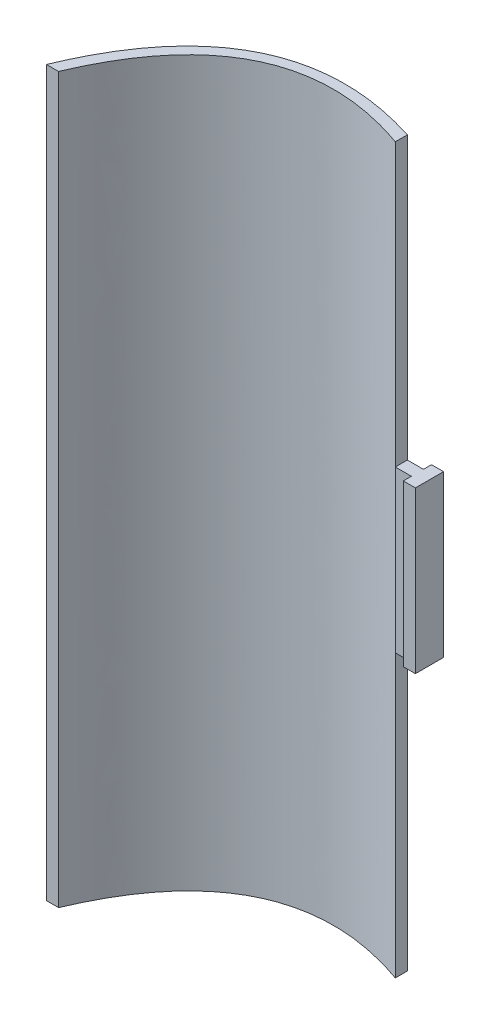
ISO-10303-21;
HEADER;
FILE_DESCRIPTION(('STEP AP214'),'2;1');
FILE_NAME('part.step','',(''),(''),'','','');
FILE_SCHEMA(('AUTOMOTIVE_DESIGN { 1 0 10303 214 1 1 1 1 }'));
ENDSEC;
DATA;
#1=APPLICATION_CONTEXT('core data for automotive mechanical design processes');
#2=APPLICATION_PROTOCOL_DEFINITION('international standard','automotive_design',2000,#1);
#3=PRODUCT_CONTEXT('',#1,'mechanical');
#4=PRODUCT('Part','Part','',(#3));
#5=PRODUCT_RELATED_PRODUCT_CATEGORY('part','',(#4));
#6=PRODUCT_DEFINITION_FORMATION('','',#4);
#7=PRODUCT_DEFINITION_CONTEXT('part definition',#1,'design');
#8=PRODUCT_DEFINITION('design','',#6,#7);
#9=PRODUCT_DEFINITION_SHAPE('','',#8);
#10=(LENGTH_UNIT() NAMED_UNIT(*) SI_UNIT(.MILLI.,.METRE.));
#11=(NAMED_UNIT(*) PLANE_ANGLE_UNIT() SI_UNIT($,.RADIAN.));
#12=(NAMED_UNIT(*) SI_UNIT($,.STERADIAN.) SOLID_ANGLE_UNIT());
#13=UNCERTAINTY_MEASURE_WITH_UNIT(LENGTH_MEASURE(1.E-05),#10,'distance_accuracy_value','');
#14=(GEOMETRIC_REPRESENTATION_CONTEXT(3) GLOBAL_UNCERTAINTY_ASSIGNED_CONTEXT((#13)) GLOBAL_UNIT_ASSIGNED_CONTEXT((#10,
#11,#12)) REPRESENTATION_CONTEXT('',''));
#15=CARTESIAN_POINT('',(0.,0.,0.));
#16=DIRECTION('',(0.,0.,1.));
#17=DIRECTION('',(1.,0.,0.));
#18=AXIS2_PLACEMENT_3D('',#15,#16,#17);
#19=CARTESIAN_POINT('',(0.,0.,0.));
#20=DIRECTION('',(1.,0.,0.));
#21=DIRECTION('',(0.,0.,-1.));
#22=AXIS2_PLACEMENT_3D('',#19,#20,#21);
#23=PLANE('',#22);
#24=DIRECTION('',(2.51650552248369E-13,-1.,-5.47594377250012E-13));
#25=VECTOR('',#24,1.);
#26=CARTESIAN_POINT('',(-2.26485497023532E-11,90.,-21.3963666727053));
#27=LINE('',#26,#25);
#28=CARTESIAN_POINT('',(-1.76155386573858E-11,70.,-21.3963666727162));
#29=VERTEX_POINT('',#28);
#30=CARTESIAN_POINT('',(0.,0.,-21.3963666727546));
#31=VERTEX_POINT('',#30);
#32=EDGE_CURVE('E287',#29,#31,#27,.T.);
#33=ORIENTED_EDGE('',*,*,#32,.F.);
#34=DIRECTION('',(0.,0.,1.));
#35=VECTOR('',#34,1.);
#36=CARTESIAN_POINT('',(0.,70.,-21.3963666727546));
#37=LINE('',#36,#35);
#38=CARTESIAN_POINT('',(0.,70.,-18.3963666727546));
#39=VERTEX_POINT('',#38);
#40=EDGE_CURVE('E80',#29,#39,#37,.T.);
#41=ORIENTED_EDGE('',*,*,#40,.T.);
#42=DIRECTION('',(-2.53541514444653E-13,1.,6.80300723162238E-13));
#43=VECTOR('',#42,1.);
#44=CARTESIAN_POINT('',(-2.2818368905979E-11,90.,-18.3963666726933));
#45=LINE('',#44,#43);
#46=CARTESIAN_POINT('',(0.,0.,-18.3963666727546));
#47=VERTEX_POINT('',#46);
#48=EDGE_CURVE('E186',#47,#39,#45,.T.);
#49=ORIENTED_EDGE('',*,*,#48,.F.);
#50=DIRECTION('',(0.,0.,-1.));
#51=VECTOR('',#50,1.);
#52=CARTESIAN_POINT('',(0.,0.,-21.3963666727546));
#53=LINE('',#52,#51);
#54=EDGE_CURVE('E12',#47,#31,#53,.T.);
#55=ORIENTED_EDGE('',*,*,#54,.T.);
#56=EDGE_LOOP('',(#33,#41,#49,#55));
#57=FACE_BOUND('',#56,.T.);
#58=ADVANCED_FACE('F61',(#57),#23,.T.);
#59=CARTESIAN_POINT('',(-36.0978004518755,0.,-20.7137251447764));
#60=DIRECTION('',(0.,-1.,0.));
#61=DIRECTION('',(0.,0.,-1.));
#62=AXIS2_PLACEMENT_3D('',#59,#60,#61);
#63=PLANE('',#62);
#64=CARTESIAN_POINT('',(0.,0.,-21.3963666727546));
#65=CARTESIAN_POINT('',(-42.195600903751,0.,-34.883026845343));
#66=CARTESIAN_POINT('',(-60.,0.,8.30751978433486));
#67=B_SPLINE_CURVE_WITH_KNOTS('',2,(#64,#65,#66),.UNSPECIFIED.,.F.,.F.,(3,3),(0.,1.),.UNSPECIFIED.);
#68=CARTESIAN_POINT('',(-60.,0.,8.30751978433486));
#69=VERTEX_POINT('',#68);
#70=EDGE_CURVE('E303',#31,#69,#67,.T.);
#71=ORIENTED_EDGE('',*,*,#70,.F.);
#72=ORIENTED_EDGE('',*,*,#54,.F.);
#73=CARTESIAN_POINT('',(-57.,0.,8.30751978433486));
#74=CARTESIAN_POINT('',(-39.7655888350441,0.,-32.5574239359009));
#75=CARTESIAN_POINT('',(0.,0.,-18.3963666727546));
#76=B_SPLINE_CURVE_WITH_KNOTS('',2,(#73,#74,#75),.UNSPECIFIED.,.F.,.F.,(3,3),(0.,1.),.UNSPECIFIED.);
#77=CARTESIAN_POINT('',(-57.,0.,8.30751978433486));
#78=VERTEX_POINT('',#77);
#79=EDGE_CURVE('E72',#78,#47,#76,.T.);
#80=ORIENTED_EDGE('',*,*,#79,.F.);
#81=DIRECTION('',(1.,0.,0.));
#82=VECTOR('',#81,1.);
#83=CARTESIAN_POINT('',(-60.,0.,8.30751978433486));
#84=LINE('',#83,#82);
#85=EDGE_CURVE('E88',#69,#78,#84,.T.);
#86=ORIENTED_EDGE('',*,*,#85,.F.);
#87=EDGE_LOOP('',(#71,#72,#80,#86));
#88=FACE_BOUND('',#87,.T.);
#89=ADVANCED_FACE('F63',(#88),#63,.T.);
#90=CARTESIAN_POINT('',(-34.343404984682,180.,-21.5248402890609));
#91=DIRECTION('',(0.,-1.,0.));
#92=DIRECTION('',(0.,0.,-1.));
#93=AXIS2_PLACEMENT_3D('',#90,#91,#92);
#94=PLANE('',#93);
#95=CARTESIAN_POINT('',(403084.799148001,180.,915165.55683891));
#96=CARTESIAN_POINT('',(-395335.670160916,180.,-918573.026425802));
#97=CARTESIAN_POINT('',(387449.167553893,180.,921894.396651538));
#98=B_SPLINE_CURVE_WITH_KNOTS('',2,(#95,#96,#97),.UNSPECIFIED.,.F.,.F.,(3,3),(0.,1.),.UNSPECIFIED.);
#99=CARTESIAN_POINT('',(0.,180.,-21.3963666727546));
#100=VERTEX_POINT('',#99);
#101=CARTESIAN_POINT('',(-60.,180.,8.30751978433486));
#102=VERTEX_POINT('',#101);
#103=EDGE_CURVE('E191',#100,#102,#98,.T.);
#104=ORIENTED_EDGE('',*,*,#103,.T.);
#105=DIRECTION('',(1.,0.,0.));
#106=VECTOR('',#105,1.);
#107=CARTESIAN_POINT('',(-60.,180.,8.30751978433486));
#108=LINE('',#107,#106);
#109=CARTESIAN_POINT('',(-56.9999999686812,180.,8.30751971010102));
#110=VERTEX_POINT('',#109);
#111=EDGE_CURVE('E194',#102,#110,#108,.T.);
#112=ORIENTED_EDGE('',*,*,#111,.T.);
#113=CARTESIAN_POINT('',(371351.134674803,180.,928495.790330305));
#114=CARTESIAN_POINT('',(-378961.382147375,180.,-925445.308658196));
#115=CARTESIAN_POINT('',(386441.129628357,180.,922316.977564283));
#116=B_SPLINE_CURVE_WITH_KNOTS('',2,(#113,#114,#115),.UNSPECIFIED.,.F.,.F.,(3,3),(0.,1.),.UNSPECIFIED.);
#117=CARTESIAN_POINT('',(0.,180.,-18.3963666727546));
#118=VERTEX_POINT('',#117);
#119=EDGE_CURVE('E523',#110,#118,#116,.T.);
#120=ORIENTED_EDGE('',*,*,#119,.T.);
#121=DIRECTION('',(0.,0.,-1.));
#122=VECTOR('',#121,1.);
#123=CARTESIAN_POINT('',(0.,180.,-21.3963666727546));
#124=LINE('',#123,#122);
#125=EDGE_CURVE('E182',#118,#100,#124,.T.);
#126=ORIENTED_EDGE('',*,*,#125,.T.);
#127=EDGE_LOOP('',(#104,#112,#120,#126));
#128=FACE_BOUND('',#127,.T.);
#129=ADVANCED_FACE('F247',(#128),#94,.F.);
#130=CARTESIAN_POINT('',(-4.56371052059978E-11,180.,-18.3963666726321));
#131=CARTESIAN_POINT('',(0.,0.,-18.3963666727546));
#132=CARTESIAN_POINT('',(-39.7655887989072,180.,-32.5574239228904));
#133=CARTESIAN_POINT('',(-39.7655888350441,0.,-32.5574239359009));
#134=CARTESIAN_POINT('',(-56.9999999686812,180.,8.30751971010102));
#135=CARTESIAN_POINT('',(-57.,0.,8.30751978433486));
#136=B_SPLINE_SURFACE_WITH_KNOTS('',2,1,((#130,#131),(#132,#133),(#134,#135)),.UNSPECIFIED.,.F.,
.F.,.F.,(3,3),(2,2),(0.,1.),(0.,1.),.UNSPECIFIED.);
#137=DIRECTION('',(-1.73993227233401E-10,-1.,4.12410248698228E-10));
#138=VECTOR('',#137,1.);
#139=CARTESIAN_POINT('',(-56.9999999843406,90.,8.30751974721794));
#140=LINE('',#139,#138);
#141=EDGE_CURVE('E262',#110,#78,#140,.T.);
#142=DIRECTION('',(0.,-1.,0.));
#143=VECTOR('',#142,1.);
#144=CARTESIAN_POINT('',(0.,110.,-18.3963666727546));
#145=LINE('',#144,#143);
#146=CARTESIAN_POINT('',(0.,110.,-18.3963666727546));
#147=VERTEX_POINT('',#146);
#148=EDGE_CURVE('E161',#147,#39,#145,.T.);
#149=EDGE_CURVE('E66',#147,#118,#45,.T.);
#150=ORIENTED_EDGE('',*,*,#119,.F.);
#151=ORIENTED_EDGE('',*,*,#141,.T.);
#152=ORIENTED_EDGE('',*,*,#79,.T.);
#153=ORIENTED_EDGE('',*,*,#48,.T.);
#154=ORIENTED_EDGE('',*,*,#148,.F.);
#155=ORIENTED_EDGE('',*,*,#149,.T.);
#156=EDGE_LOOP('',(#150,#151,#152,#153,#154,#155));
#157=FACE_BOUND('',#156,.T.);
#158=ADVANCED_FACE('F188',(#157),#136,.T.);
#159=CARTESIAN_POINT('',(0.,0.,8.30751978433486));
#160=DIRECTION('',(0.,0.,1.));
#161=DIRECTION('',(1.,0.,0.));
#162=AXIS2_PLACEMENT_3D('',#159,#160,#161);
#163=PLANE('',#162);
#164=DIRECTION('',(0.,-1.,0.));
#165=VECTOR('',#164,1.);
#166=CARTESIAN_POINT('',(-60.,180.,8.30751978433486));
#167=LINE('',#166,#165);
#168=EDGE_CURVE('E269',#102,#69,#167,.T.);
#169=ORIENTED_EDGE('',*,*,#168,.T.);
#170=ORIENTED_EDGE('',*,*,#85,.T.);
#171=ORIENTED_EDGE('',*,*,#141,.F.);
#172=ORIENTED_EDGE('',*,*,#111,.F.);
#173=EDGE_LOOP('',(#169,#170,#171,#172));
#174=FACE_BOUND('',#173,.T.);
#175=ADVANCED_FACE('F213',(#174),#163,.T.);
#176=DIRECTION('',(0.,0.,1.));
#177=VECTOR('',#176,1.);
#178=CARTESIAN_POINT('',(0.,110.,-21.3963666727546));
#179=LINE('',#178,#177);
#180=CARTESIAN_POINT('',(0.,110.,-21.3963666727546));
#181=VERTEX_POINT('',#180);
#182=EDGE_CURVE('E167',#181,#147,#179,.T.);
#183=ORIENTED_EDGE('',*,*,#182,.F.);
#184=EDGE_CURVE('E300',#100,#181,#27,.T.);
#185=ORIENTED_EDGE('',*,*,#184,.F.);
#186=ORIENTED_EDGE('',*,*,#125,.F.);
#187=ORIENTED_EDGE('',*,*,#149,.F.);
#188=EDGE_LOOP('',(#183,#185,#186,#187));
#189=FACE_BOUND('',#188,.T.);
#190=ADVANCED_FACE('F181',(#189),#23,.T.);
#191=CARTESIAN_POINT('',(-59.999999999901,180.,8.30751978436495));
#192=CARTESIAN_POINT('',(-60.,0.,8.30751978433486));
#193=CARTESIAN_POINT('',(-42.1956009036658,180.,-34.8830268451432));
#194=CARTESIAN_POINT('',(-42.195600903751,0.,-34.883026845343));
#195=CARTESIAN_POINT('',(-4.52970994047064E-11,180.,-21.396366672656));
#196=CARTESIAN_POINT('',(0.,0.,-21.3963666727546));
#197=B_SPLINE_SURFACE_WITH_KNOTS('',2,1,((#191,#192),(#193,#194),(#195,#196)),.UNSPECIFIED.,.F.,
.F.,.F.,(3,3),(2,2),(0.,1.),(0.,1.),.UNSPECIFIED.);
#198=DIRECTION('',(0.,-1.,0.));
#199=VECTOR('',#198,1.);
#200=CARTESIAN_POINT('',(0.,110.,-21.3963666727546));
#201=LINE('',#200,#199);
#202=EDGE_CURVE('E371',#181,#29,#201,.T.);
#203=ORIENTED_EDGE('',*,*,#103,.F.);
#204=ORIENTED_EDGE('',*,*,#184,.T.);
#205=ORIENTED_EDGE('',*,*,#202,.T.);
#206=ORIENTED_EDGE('',*,*,#32,.T.);
#207=ORIENTED_EDGE('',*,*,#70,.T.);
#208=ORIENTED_EDGE('',*,*,#168,.F.);
#209=EDGE_LOOP('',(#203,#204,#205,#206,#207,#208));
#210=FACE_BOUND('',#209,.T.);
#211=ADVANCED_FACE('F212',(#210),#197,.T.);
#212=CARTESIAN_POINT('',(0.,110.,-18.3963666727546));
#213=DIRECTION('',(0.,0.,-1.));
#214=DIRECTION('',(-1.,0.,0.));
#215=AXIS2_PLACEMENT_3D('',#212,#213,#214);
#216=PLANE('',#215);
#217=DIRECTION('',(1.,0.,0.));
#218=VECTOR('',#217,1.);
#219=CARTESIAN_POINT('',(0.,70.,-18.3963666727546));
#220=LINE('',#219,#218);
#221=CARTESIAN_POINT('',(4.,70.,-18.3963666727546));
#222=VERTEX_POINT('',#221);
#223=EDGE_CURVE('E354',#39,#222,#220,.T.);
#224=ORIENTED_EDGE('',*,*,#223,.T.);
#225=DIRECTION('',(0.,-1.,0.));
#226=VECTOR('',#225,1.);
#227=CARTESIAN_POINT('',(4.,110.,-18.3963666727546));
#228=LINE('',#227,#226);
#229=CARTESIAN_POINT('',(4.,110.,-18.3963666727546));
#230=VERTEX_POINT('',#229);
#231=EDGE_CURVE('E163',#230,#222,#228,.T.);
#232=ORIENTED_EDGE('',*,*,#231,.F.);
#233=DIRECTION('',(1.,0.,0.));
#234=VECTOR('',#233,1.);
#235=CARTESIAN_POINT('',(0.,110.,-18.3963666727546));
#236=LINE('',#235,#234);
#237=EDGE_CURVE('E157',#147,#230,#236,.T.);
#238=ORIENTED_EDGE('',*,*,#237,.F.);
#239=ORIENTED_EDGE('',*,*,#148,.T.);
#240=EDGE_LOOP('',(#224,#232,#238,#239));
#241=FACE_BOUND('',#240,.T.);
#242=ADVANCED_FACE('F159',(#241),#216,.F.);
#243=CARTESIAN_POINT('',(4.,110.,-18.3963666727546));
#244=DIRECTION('',(1.,0.,0.));
#245=DIRECTION('',(0.,0.,-1.));
#246=AXIS2_PLACEMENT_3D('',#243,#244,#245);
#247=PLANE('',#246);
#248=DIRECTION('',(0.,0.,1.));
#249=VECTOR('',#248,1.);
#250=CARTESIAN_POINT('',(4.,70.,-18.3963666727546));
#251=LINE('',#250,#249);
#252=CARTESIAN_POINT('',(4.,70.,-16.3963666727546));
#253=VERTEX_POINT('',#252);
#254=EDGE_CURVE('E356',#222,#253,#251,.T.);
#255=ORIENTED_EDGE('',*,*,#254,.T.);
#256=DIRECTION('',(0.,-1.,0.));
#257=VECTOR('',#256,1.);
#258=CARTESIAN_POINT('',(4.,110.,-16.3963666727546));
#259=LINE('',#258,#257);
#260=CARTESIAN_POINT('',(4.,110.,-16.3963666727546));
#261=VERTEX_POINT('',#260);
#262=EDGE_CURVE('E196',#261,#253,#259,.T.);
#263=ORIENTED_EDGE('',*,*,#262,.F.);
#264=DIRECTION('',(0.,0.,1.));
#265=VECTOR('',#264,1.);
#266=CARTESIAN_POINT('',(4.,110.,-18.3963666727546));
#267=LINE('',#266,#265);
#268=EDGE_CURVE('E166',#230,#261,#267,.T.);
#269=ORIENTED_EDGE('',*,*,#268,.F.);
#270=ORIENTED_EDGE('',*,*,#231,.T.);
#271=EDGE_LOOP('',(#255,#263,#269,#270));
#272=FACE_BOUND('',#271,.T.);
#273=ADVANCED_FACE('F414',(#272),#247,.F.);
#274=CARTESIAN_POINT('',(4.,110.,-16.3963666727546));
#275=DIRECTION('',(0.,0.,-1.));
#276=DIRECTION('',(-1.,0.,0.));
#277=AXIS2_PLACEMENT_3D('',#274,#275,#276);
#278=PLANE('',#277);
#279=DIRECTION('',(1.,0.,0.));
#280=VECTOR('',#279,1.);
#281=CARTESIAN_POINT('',(4.,70.,-16.3963666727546));
#282=LINE('',#281,#280);
#283=CARTESIAN_POINT('',(7.,70.,-16.3963666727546));
#284=VERTEX_POINT('',#283);
#285=EDGE_CURVE('E362',#253,#284,#282,.T.);
#286=ORIENTED_EDGE('',*,*,#285,.T.);
#287=DIRECTION('',(0.,-1.,0.));
#288=VECTOR('',#287,1.);
#289=CARTESIAN_POINT('',(7.,110.,-16.3963666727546));
#290=LINE('',#289,#288);
#291=CARTESIAN_POINT('',(7.,110.,-16.3963666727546));
#292=VERTEX_POINT('',#291);
#293=EDGE_CURVE('E382',#292,#284,#290,.T.);
#294=ORIENTED_EDGE('',*,*,#293,.F.);
#295=DIRECTION('',(1.,0.,0.));
#296=VECTOR('',#295,1.);
#297=CARTESIAN_POINT('',(4.,110.,-16.3963666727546));
#298=LINE('',#297,#296);
#299=EDGE_CURVE('E391',#261,#292,#298,.T.);
#300=ORIENTED_EDGE('',*,*,#299,.F.);
#301=ORIENTED_EDGE('',*,*,#262,.T.);
#302=EDGE_LOOP('',(#286,#294,#300,#301));
#303=FACE_BOUND('',#302,.T.);
#304=ADVANCED_FACE('F389',(#303),#278,.F.);
#305=CARTESIAN_POINT('',(7.,110.,-23.3963666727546));
#306=DIRECTION('',(-1.,0.,0.));
#307=DIRECTION('',(0.,0.,1.));
#308=AXIS2_PLACEMENT_3D('',#305,#306,#307);
#309=PLANE('',#308);
#310=DIRECTION('',(0.,0.,-1.));
#311=VECTOR('',#310,1.);
#312=CARTESIAN_POINT('',(7.,70.,-23.3963666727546));
#313=LINE('',#312,#311);
#314=CARTESIAN_POINT('',(7.,70.,-23.3963666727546));
#315=VERTEX_POINT('',#314);
#316=EDGE_CURVE('E364',#284,#315,#313,.T.);
#317=ORIENTED_EDGE('',*,*,#316,.T.);
#318=DIRECTION('',(0.,-1.,0.));
#319=VECTOR('',#318,1.);
#320=CARTESIAN_POINT('',(7.,110.,-23.3963666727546));
#321=LINE('',#320,#319);
#322=CARTESIAN_POINT('',(7.,110.,-23.3963666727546));
#323=VERTEX_POINT('',#322);
#324=EDGE_CURVE('E379',#323,#315,#321,.T.);
#325=ORIENTED_EDGE('',*,*,#324,.F.);
#326=DIRECTION('',(0.,0.,-1.));
#327=VECTOR('',#326,1.);
#328=CARTESIAN_POINT('',(7.,110.,-23.3963666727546));
#329=LINE('',#328,#327);
#330=EDGE_CURVE('E409',#292,#323,#329,.T.);
#331=ORIENTED_EDGE('',*,*,#330,.F.);
#332=ORIENTED_EDGE('',*,*,#293,.T.);
#333=EDGE_LOOP('',(#317,#325,#331,#332));
#334=FACE_BOUND('',#333,.T.);
#335=ADVANCED_FACE('F400',(#334),#309,.F.);
#336=CARTESIAN_POINT('',(4.,110.,-23.3963666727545));
#337=DIRECTION('',(0.,0.,1.));
#338=DIRECTION('',(1.,0.,0.));
#339=AXIS2_PLACEMENT_3D('',#336,#337,#338);
#340=PLANE('',#339);
#341=DIRECTION('',(-1.,0.,0.));
#342=VECTOR('',#341,1.);
#343=CARTESIAN_POINT('',(4.,70.,-23.3963666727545));
#344=LINE('',#343,#342);
#345=CARTESIAN_POINT('',(4.,70.,-23.3963666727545));
#346=VERTEX_POINT('',#345);
#347=EDGE_CURVE('E366',#315,#346,#344,.T.);
#348=ORIENTED_EDGE('',*,*,#347,.T.);
#349=DIRECTION('',(0.,-1.,0.));
#350=VECTOR('',#349,1.);
#351=CARTESIAN_POINT('',(4.,110.,-23.3963666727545));
#352=LINE('',#351,#350);
#353=CARTESIAN_POINT('',(4.,110.,-23.3963666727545));
#354=VERTEX_POINT('',#353);
#355=EDGE_CURVE('E376',#354,#346,#352,.T.);
#356=ORIENTED_EDGE('',*,*,#355,.F.);
#357=DIRECTION('',(-1.,0.,0.));
#358=VECTOR('',#357,1.);
#359=CARTESIAN_POINT('',(4.,110.,-23.3963666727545));
#360=LINE('',#359,#358);
#361=EDGE_CURVE('E406',#323,#354,#360,.T.);
#362=ORIENTED_EDGE('',*,*,#361,.F.);
#363=ORIENTED_EDGE('',*,*,#324,.T.);
#364=EDGE_LOOP('',(#348,#356,#362,#363));
#365=FACE_BOUND('',#364,.T.);
#366=ADVANCED_FACE('F404',(#365),#340,.F.);
#367=CARTESIAN_POINT('',(4.,110.,-23.3963666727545));
#368=DIRECTION('',(1.,0.,0.));
#369=DIRECTION('',(0.,0.,-1.));
#370=AXIS2_PLACEMENT_3D('',#367,#368,#369);
#371=PLANE('',#370);
#372=DIRECTION('',(0.,0.,1.));
#373=VECTOR('',#372,1.);
#374=CARTESIAN_POINT('',(4.,70.,-23.3963666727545));
#375=LINE('',#374,#373);
#376=CARTESIAN_POINT('',(4.,70.,-21.3963666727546));
#377=VERTEX_POINT('',#376);
#378=EDGE_CURVE('E368',#346,#377,#375,.T.);
#379=ORIENTED_EDGE('',*,*,#378,.T.);
#380=DIRECTION('',(0.,-1.,0.));
#381=VECTOR('',#380,1.);
#382=CARTESIAN_POINT('',(4.,110.,-21.3963666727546));
#383=LINE('',#382,#381);
#384=CARTESIAN_POINT('',(4.,110.,-21.3963666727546));
#385=VERTEX_POINT('',#384);
#386=EDGE_CURVE('E373',#385,#377,#383,.T.);
#387=ORIENTED_EDGE('',*,*,#386,.F.);
#388=DIRECTION('',(0.,0.,1.));
#389=VECTOR('',#388,1.);
#390=CARTESIAN_POINT('',(4.,110.,-23.3963666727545));
#391=LINE('',#390,#389);
#392=EDGE_CURVE('E408',#354,#385,#391,.T.);
#393=ORIENTED_EDGE('',*,*,#392,.F.);
#394=ORIENTED_EDGE('',*,*,#355,.T.);
#395=EDGE_LOOP('',(#379,#387,#393,#394));
#396=FACE_BOUND('',#395,.T.);
#397=ADVANCED_FACE('F481',(#396),#371,.F.);
#398=CARTESIAN_POINT('',(0.,110.,-21.3963666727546));
#399=DIRECTION('',(0.,0.,1.));
#400=DIRECTION('',(1.,0.,0.));
#401=AXIS2_PLACEMENT_3D('',#398,#399,#400);
#402=PLANE('',#401);
#403=DIRECTION('',(-1.,0.,0.));
#404=VECTOR('',#403,1.);
#405=CARTESIAN_POINT('',(0.,70.,-21.3963666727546));
#406=LINE('',#405,#404);
#407=EDGE_CURVE('E178',#377,#29,#406,.T.);
#408=ORIENTED_EDGE('',*,*,#407,.T.);
#409=ORIENTED_EDGE('',*,*,#202,.F.);
#410=DIRECTION('',(-1.,0.,0.));
#411=VECTOR('',#410,1.);
#412=CARTESIAN_POINT('',(0.,110.,-21.3963666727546));
#413=LINE('',#412,#411);
#414=EDGE_CURVE('E173',#385,#181,#413,.T.);
#415=ORIENTED_EDGE('',*,*,#414,.F.);
#416=ORIENTED_EDGE('',*,*,#386,.T.);
#417=EDGE_LOOP('',(#408,#409,#415,#416));
#418=FACE_BOUND('',#417,.T.);
#419=ADVANCED_FACE('F490',(#418),#402,.F.);
#420=CARTESIAN_POINT('',(0.,110.,0.));
#421=DIRECTION('',(0.,1.,0.));
#422=DIRECTION('',(0.,0.,1.));
#423=AXIS2_PLACEMENT_3D('',#420,#421,#422);
#424=PLANE('',#423);
#425=ORIENTED_EDGE('',*,*,#182,.T.);
#426=ORIENTED_EDGE('',*,*,#237,.T.);
#427=ORIENTED_EDGE('',*,*,#268,.T.);
#428=ORIENTED_EDGE('',*,*,#299,.T.);
#429=ORIENTED_EDGE('',*,*,#330,.T.);
#430=ORIENTED_EDGE('',*,*,#361,.T.);
#431=ORIENTED_EDGE('',*,*,#392,.T.);
#432=ORIENTED_EDGE('',*,*,#414,.T.);
#433=EDGE_LOOP('',(#425,#426,#427,#428,#429,#430,#431,#432));
#434=FACE_BOUND('',#433,.T.);
#435=ADVANCED_FACE('F171',(#434),#424,.T.);
#436=CARTESIAN_POINT('',(0.,70.,0.));
#437=DIRECTION('',(0.,1.,0.));
#438=DIRECTION('',(0.,0.,1.));
#439=AXIS2_PLACEMENT_3D('',#436,#437,#438);
#440=PLANE('',#439);
#441=ORIENTED_EDGE('',*,*,#40,.F.);
#442=ORIENTED_EDGE('',*,*,#407,.F.);
#443=ORIENTED_EDGE('',*,*,#378,.F.);
#444=ORIENTED_EDGE('',*,*,#347,.F.);
#445=ORIENTED_EDGE('',*,*,#316,.F.);
#446=ORIENTED_EDGE('',*,*,#285,.F.);
#447=ORIENTED_EDGE('',*,*,#254,.F.);
#448=ORIENTED_EDGE('',*,*,#223,.F.);
#449=EDGE_LOOP('',(#441,#442,#443,#444,#445,#446,#447,#448));
#450=FACE_BOUND('',#449,.T.);
#451=ADVANCED_FACE('F395',(#450),#440,.F.);
#452=CLOSED_SHELL('',(#58,#89,#129,#158,#175,#190,#211,#242,#273,#304,#335,#366,#397,#419,#435,#451));
#453=MANIFOLD_SOLID_BREP('B2',#452);
#454=ADVANCED_BREP_SHAPE_REPRESENTATION('',(#18,#453),#14);
#455=SHAPE_DEFINITION_REPRESENTATION(#9,#454);
ENDSEC;
END-ISO-10303-21;
